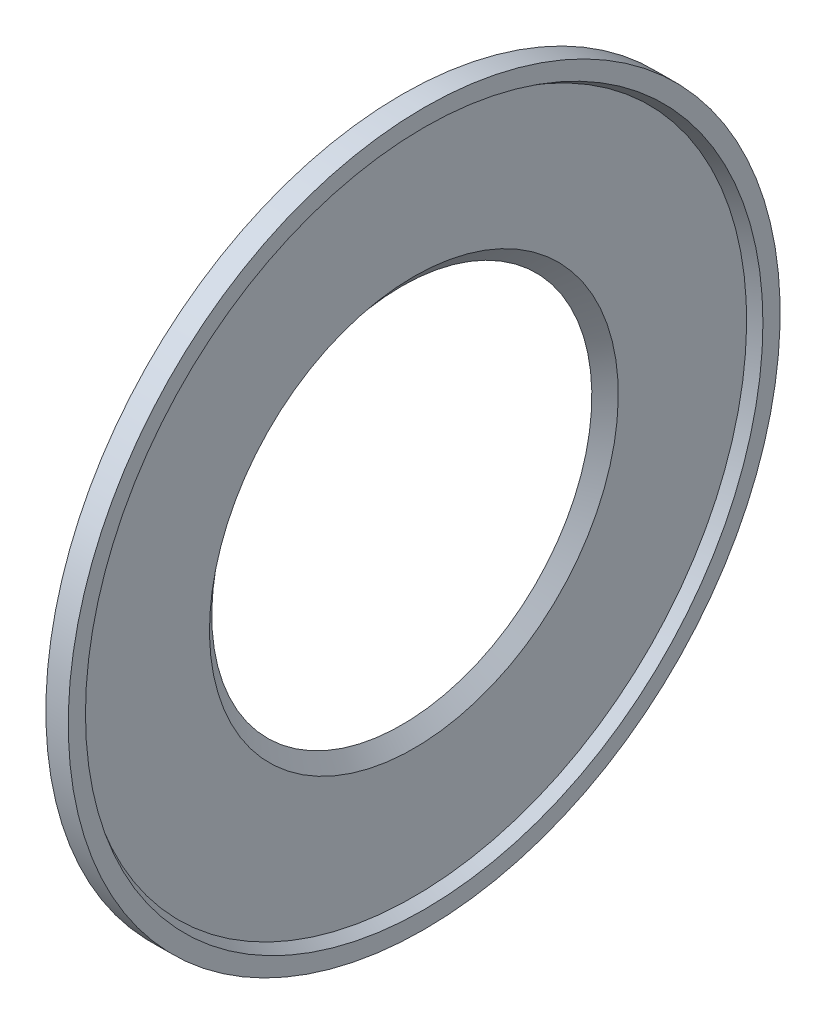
ISO-10303-21;
HEADER;
FILE_DESCRIPTION(('STEP AP214'),'2;1');
FILE_NAME('part.step','',(''),(''),'','','');
FILE_SCHEMA(('AUTOMOTIVE_DESIGN { 1 0 10303 214 1 1 1 1 }'));
ENDSEC;
DATA;
#1=APPLICATION_CONTEXT('core data for automotive mechanical design processes');
#2=APPLICATION_PROTOCOL_DEFINITION('international standard','automotive_design',2000,#1);
#3=PRODUCT_CONTEXT('',#1,'mechanical');
#4=PRODUCT('Part','Part','',(#3));
#5=PRODUCT_RELATED_PRODUCT_CATEGORY('part','',(#4));
#6=PRODUCT_DEFINITION_FORMATION('','',#4);
#7=PRODUCT_DEFINITION_CONTEXT('part definition',#1,'design');
#8=PRODUCT_DEFINITION('design','',#6,#7);
#9=PRODUCT_DEFINITION_SHAPE('','',#8);
#10=(LENGTH_UNIT() NAMED_UNIT(*) SI_UNIT(.MILLI.,.METRE.));
#11=(NAMED_UNIT(*) PLANE_ANGLE_UNIT() SI_UNIT($,.RADIAN.));
#12=(NAMED_UNIT(*) SI_UNIT($,.STERADIAN.) SOLID_ANGLE_UNIT());
#13=UNCERTAINTY_MEASURE_WITH_UNIT(LENGTH_MEASURE(1.E-05),#10,'distance_accuracy_value','');
#14=(GEOMETRIC_REPRESENTATION_CONTEXT(3) GLOBAL_UNCERTAINTY_ASSIGNED_CONTEXT((#13)) GLOBAL_UNIT_ASSIGNED_CONTEXT((#10,
#11,#12)) REPRESENTATION_CONTEXT('',''));
#15=CARTESIAN_POINT('',(0.,0.,0.));
#16=DIRECTION('',(0.,0.,1.));
#17=DIRECTION('',(1.,0.,0.));
#18=AXIS2_PLACEMENT_3D('',#15,#16,#17);
#19=CARTESIAN_POINT('',(0.,9.51,0.));
#20=DIRECTION('',(-1.,0.,0.));
#21=DIRECTION('',(0.,0.,1.));
#22=AXIS2_PLACEMENT_3D('',#19,#20,#21);
#23=PLANE('',#22);
#24=CARTESIAN_POINT('',(0.,0.,0.));
#25=DIRECTION('',(-1.,0.,0.));
#26=DIRECTION('',(0.,1.,0.));
#27=AXIS2_PLACEMENT_3D('',#24,#25,#26);
#28=CIRCLE('',#27,6.62);
#29=CARTESIAN_POINT('',(0.,6.62,0.));
#30=VERTEX_POINT('',#29);
#31=EDGE_CURVE('E39',#30,#30,#28,.T.);
#32=ORIENTED_EDGE('',*,*,#31,.F.);
#33=EDGE_LOOP('',(#32));
#34=FACE_BOUND('',#33,.T.);
#35=CARTESIAN_POINT('',(0.,0.,0.));
#36=DIRECTION('',(-1.,0.,0.));
#37=DIRECTION('',(0.,1.,0.));
#38=AXIS2_PLACEMENT_3D('',#35,#36,#37);
#39=CIRCLE('',#38,12.4);
#40=CARTESIAN_POINT('',(0.,12.4,0.));
#41=VERTEX_POINT('',#40);
#42=EDGE_CURVE('E10',#41,#41,#39,.T.);
#43=ORIENTED_EDGE('',*,*,#42,.T.);
#44=EDGE_LOOP('',(#43));
#45=FACE_BOUND('',#44,.T.);
#46=ADVANCED_FACE('F15',(#34,#45),#23,.T.);
#47=CARTESIAN_POINT('',(0.78,12.1,0.));
#48=DIRECTION('',(1.,0.,0.));
#49=DIRECTION('',(0.,1.,0.));
#50=AXIS2_PLACEMENT_3D('',#47,#48,#49);
#51=PLANE('',#50);
#52=CARTESIAN_POINT('',(0.779999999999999,0.,0.));
#53=DIRECTION('',(-1.,0.,0.));
#54=DIRECTION('',(0.,1.,0.));
#55=AXIS2_PLACEMENT_3D('',#52,#53,#54);
#56=CIRCLE('',#55,11.8);
#57=CARTESIAN_POINT('',(0.779999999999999,11.8,0.));
#58=VERTEX_POINT('',#57);
#59=EDGE_CURVE('E24',#58,#58,#56,.T.);
#60=ORIENTED_EDGE('',*,*,#59,.T.);
#61=EDGE_LOOP('',(#60));
#62=FACE_BOUND('',#61,.T.);
#63=CARTESIAN_POINT('',(0.78,0.,0.));
#64=DIRECTION('',(-1.,0.,0.));
#65=DIRECTION('',(0.,1.,0.));
#66=AXIS2_PLACEMENT_3D('',#63,#64,#65);
#67=CIRCLE('',#66,12.4);
#68=CARTESIAN_POINT('',(0.78,12.4,0.));
#69=VERTEX_POINT('',#68);
#70=EDGE_CURVE('E46',#69,#69,#67,.T.);
#71=ORIENTED_EDGE('',*,*,#70,.F.);
#72=EDGE_LOOP('',(#71));
#73=FACE_BOUND('',#72,.T.);
#74=ADVANCED_FACE('F67',(#62,#73),#51,.T.);
#75=CARTESIAN_POINT('',(0.42,9.35634520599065,0.));
#76=DIRECTION('',(1.,0.,0.));
#77=DIRECTION('',(0.,0.,-1.));
#78=AXIS2_PLACEMENT_3D('',#75,#76,#77);
#79=PLANE('',#78);
#80=CARTESIAN_POINT('',(0.42,0.,0.));
#81=DIRECTION('',(-1.,0.,0.));
#82=DIRECTION('',(0.,1.,0.));
#83=AXIS2_PLACEMENT_3D('',#80,#81,#82);
#84=CIRCLE('',#83,7.12053650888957);
#85=CARTESIAN_POINT('',(0.42,7.12053650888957,0.));
#86=VERTEX_POINT('',#85);
#87=EDGE_CURVE('E34',#86,#86,#84,.T.);
#88=ORIENTED_EDGE('',*,*,#87,.T.);
#89=EDGE_LOOP('',(#88));
#90=FACE_BOUND('',#89,.T.);
#91=CARTESIAN_POINT('',(0.42,0.,0.));
#92=DIRECTION('',(-1.,0.,0.));
#93=DIRECTION('',(0.,1.,0.));
#94=AXIS2_PLACEMENT_3D('',#91,#92,#93);
#95=CIRCLE('',#94,11.5921539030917);
#96=CARTESIAN_POINT('',(0.42,11.5921539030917,0.));
#97=VERTEX_POINT('',#96);
#98=EDGE_CURVE('E38',#97,#97,#95,.T.);
#99=ORIENTED_EDGE('',*,*,#98,.F.);
#100=EDGE_LOOP('',(#99));
#101=FACE_BOUND('',#100,.T.);
#102=ADVANCED_FACE('F54',(#90,#101),#79,.T.);
#103=DIRECTION('',(0.642787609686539,0.766044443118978,0.));
#104=VECTOR('',#103,1.);
#105=CARTESIAN_POINT('',(418705.161117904,499000.,-1.22215714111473E-10));
#106=LINE('',#105,#104);
#107=CARTESIAN_POINT('',(-5.55483955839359,0.,0.));
#108=DIRECTION('',(1.,0.,0.));
#109=AXIS1_PLACEMENT('',#107,#108);
#110=SURFACE_OF_REVOLUTION('',#106,#109);
#111=ORIENTED_EDGE('',*,*,#87,.F.);
#112=EDGE_LOOP('',(#111));
#113=FACE_BOUND('',#112,.T.);
#114=ORIENTED_EDGE('',*,*,#31,.T.);
#115=EDGE_LOOP('',(#114));
#116=FACE_BOUND('',#115,.T.);
#117=ADVANCED_FACE('F50',(#113,#116),#110,.F.);
#118=DIRECTION('',(0.866025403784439,0.499999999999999,0.));
#119=VECTOR('',#118,1.);
#120=CARTESIAN_POINT('',(0.6,11.6960769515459,0.));
#121=LINE('',#120,#119);
#122=CARTESIAN_POINT('',(-19.6581995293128,0.,0.));
#123=DIRECTION('',(1.,0.,0.));
#124=AXIS1_PLACEMENT('',#122,#123);
#125=SURFACE_OF_REVOLUTION('',#121,#124);
#126=ORIENTED_EDGE('',*,*,#59,.F.);
#127=EDGE_LOOP('',(#126));
#128=FACE_BOUND('',#127,.T.);
#129=ORIENTED_EDGE('',*,*,#98,.T.);
#130=EDGE_LOOP('',(#129));
#131=FACE_BOUND('',#130,.T.);
#132=ADVANCED_FACE('F53',(#128,#131),#125,.F.);
#133=CARTESIAN_POINT('',(0.39,0.,0.));
#134=DIRECTION('',(-1.,0.,0.));
#135=DIRECTION('',(0.,0.,1.));
#136=AXIS2_PLACEMENT_3D('',#133,#134,#135);
#137=CYLINDRICAL_SURFACE('',#136,12.4);
#138=ORIENTED_EDGE('',*,*,#42,.F.);
#139=EDGE_LOOP('',(#138));
#140=FACE_BOUND('',#139,.T.);
#141=ORIENTED_EDGE('',*,*,#70,.T.);
#142=EDGE_LOOP('',(#141));
#143=FACE_BOUND('',#142,.T.);
#144=ADVANCED_FACE('F17',(#140,#143),#137,.T.);
#145=CLOSED_SHELL('',(#46,#74,#102,#117,#132,#144));
#146=MANIFOLD_SOLID_BREP('B1',#145);
#147=ADVANCED_BREP_SHAPE_REPRESENTATION('',(#18,#146),#14);
#148=SHAPE_DEFINITION_REPRESENTATION(#9,#147);
ENDSEC;
END-ISO-10303-21;
